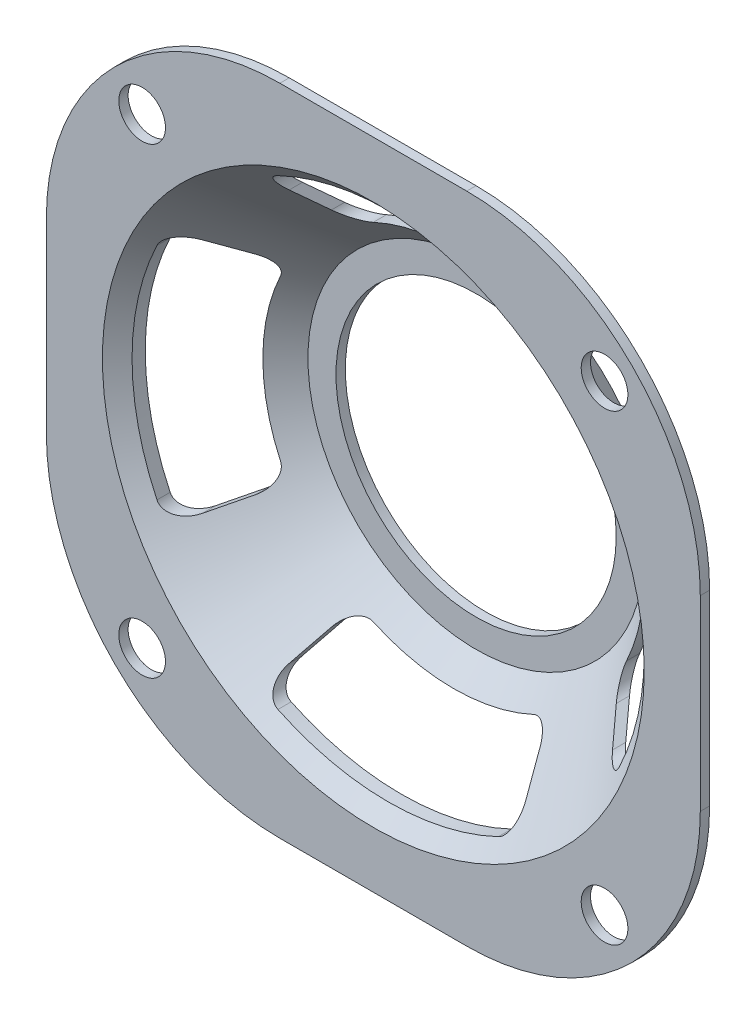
from build123d import *

# Parameters (mm, degrees)
EXTRUDE1_DEPTH     = 1
SKETCH6_R          = 30
CUT_EXTRUDE1_DEPTH = 50.507575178
SKETCH7_R          = 2.5
CUT_EXTRUDE3_DEPTH = 50.507575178
CUT_EXTRUDE4_DEPTH = 51.931326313
CIRPATTERN1_COUNT  = 4
SCALE1_SCALE       = 2


with BuildPart() as part:
    # Sketch1 → Extrude1 (new body)
    with BuildSketch(Plane.XY):
        with BuildLine():
            Line((-10, -35), (10, -35))
            ThreePointArc((10, -35), (27.67766953, -27.67766953), (35, -10))
            Line((35, -10), (35, 10))
            ThreePointArc((35, 10), (27.67766953, 27.67766953), (10, 35))
            Line((10, 35), (-10, 35))
            ThreePointArc((-10, 35), (-27.67766953, 27.67766953), (-35, 10))
            Line((-35, 10), (-35, -10))
            ThreePointArc((-35, -10), (-27.67766953, -27.67766953), (-10, -35))
        make_face()
    extrude(amount=-EXTRUDE1_DEPTH)

    # Sketch6 → Cut-Extrude1 (cut, through all)
    with BuildSketch(Plane(origin=(0, 0, -1), x_dir=(-1, 0, 0), z_dir=(0, 0, -1))):
        Circle(SKETCH6_R)
    extrude(amount=-CUT_EXTRUDE1_DEPTH, mode=Mode.SUBTRACT)

    # Sketch7 → Cut-Extrude3 (cut, through all)
    with BuildSketch(Plane(origin=(0, 0, -1), x_dir=(-1, 0, 0), z_dir=(0, 0, -1))):
        with Locations((-24.748737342, 24.748737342)):
            Circle(SKETCH7_R)
        with Locations((24.748737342, 24.748737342)):
            Circle(SKETCH7_R)
        with Locations((24.748737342, -24.748737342)):
            Circle(SKETCH7_R)
        with Locations((-24.748737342, -24.748737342)):
            Circle(SKETCH7_R)
    extrude(amount=-CUT_EXTRUDE3_DEPTH, mode=Mode.SUBTRACT)

    # Sketch8 → Revolve-Thin1 (revolve)
    with BuildSketch(Plane(origin=(0, 0, 0), x_dir=(0, 0, -1), z_dir=(1, 0, 0)), mode=Mode.PRIVATE) as revolve_thin1_sk:
        Polygon((0, 30), (0, 29), (11, 18), (11, 15), (12, 15), (12, 18.414213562), (1, 29.414213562), (1, 30), align=None)
    revolve(revolve_thin1_sk.sketch.rotate(Axis((0, 0, 0), (0, 0, -1)), 90), axis=Axis((0, 0, 0), (0, 0, -1)))

    # Sketch9 → Cut-Extrude4 (cut, through all)
    with BuildSketch(Plane(origin=(0, 0, -12), x_dir=(-1, 0, 0), z_dir=(0, 0, -1))):
        with BuildLine():
            Line((11.162403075, 19.33384926), (12.66769761, 21.941095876))
            ThreePointArc((12.66769761, 21.941095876), (12.845616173, 23.534406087), (11.796239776, 24.74647111))
            ThreePointArc((11.796239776, 24.74647111), (0, 27.414213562), (-11.796239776, 24.74647111))
            ThreePointArc((-11.796239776, 24.74647111), (-12.845616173, 23.534406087), (-12.66769761, 21.941095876))
            Line((-12.66769761, 21.941095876), (-11.162403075, 19.33384926))
            ThreePointArc((-11.162403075, 19.33384926), (-10.033748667, 18.4270423), (-8.588890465, 18.519478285))
            ThreePointArc((-8.588890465, 18.519478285), (0, 20.414213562), (8.588890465, 18.519478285))
            ThreePointArc((8.588890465, 18.519478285), (10.033748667, 18.4270423), (11.162403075, 19.33384926))
        make_face()
    cut_extrude4 = extrude(amount=-CUT_EXTRUDE4_DEPTH, mode=Mode.SUBTRACT)

    # CirPattern1: Cut-Extrude4 ×4 about axis
    cirpattern1_axis = Axis((0, 0, 0), (0, 0, -1))
    for i in range(1, CIRPATTERN1_COUNT):
        add(cut_extrude4.rotate(cirpattern1_axis, i * 360 / CIRPATTERN1_COUNT), mode=Mode.SUBTRACT)


with BuildPart() as part_1:
    # Scale1: scaled about (-3.9e-08, 7.39e-07, -3.68364025)
    add(part.part.scale(SCALE1_SCALE).moved(Location((3.9e-08, -7.39e-07, 3.68364025))))


solid = part_1.part
